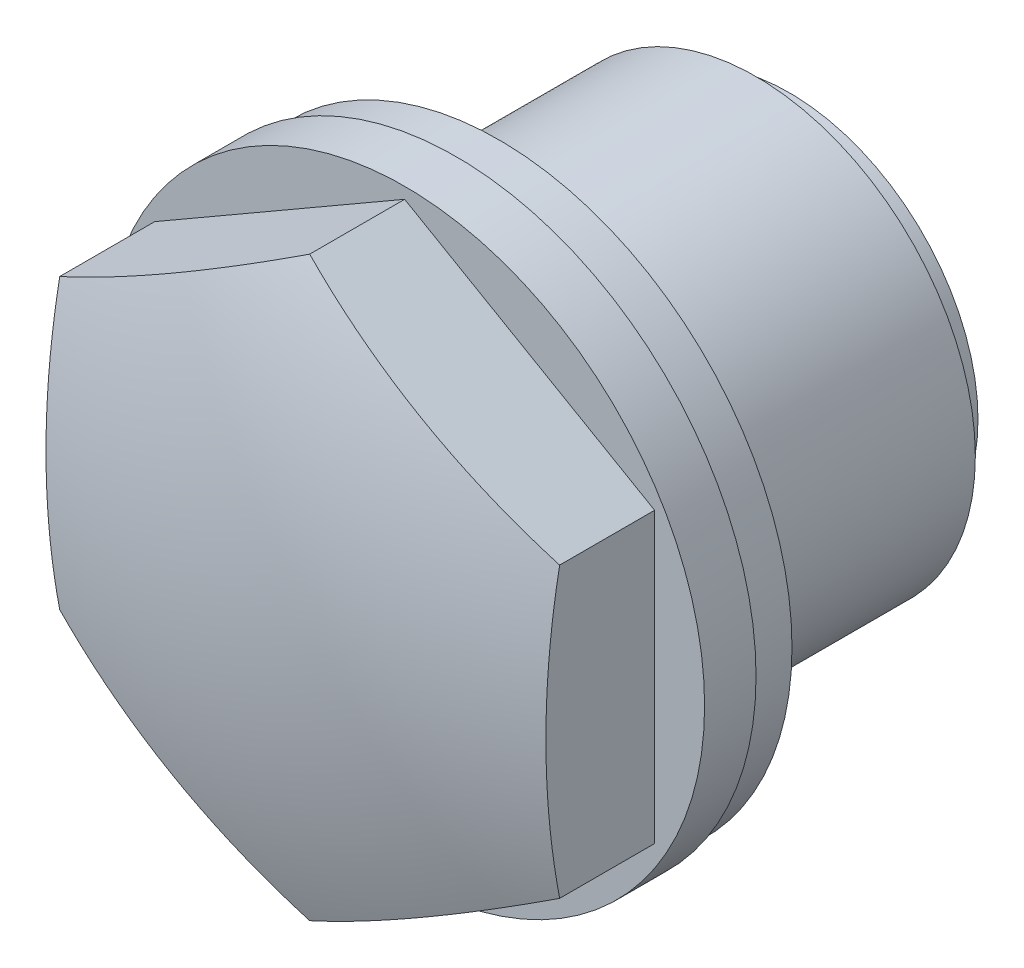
ISO-10303-21;
HEADER;
FILE_DESCRIPTION(('STEP AP214'),'2;1');
FILE_NAME('part.step','',(''),(''),'','','');
FILE_SCHEMA(('AUTOMOTIVE_DESIGN { 1 0 10303 214 1 1 1 1 }'));
ENDSEC;
DATA;
#1=APPLICATION_CONTEXT('core data for automotive mechanical design processes');
#2=APPLICATION_PROTOCOL_DEFINITION('international standard','automotive_design',2000,#1);
#3=PRODUCT_CONTEXT('',#1,'mechanical');
#4=PRODUCT('Part','Part','',(#3));
#5=PRODUCT_RELATED_PRODUCT_CATEGORY('part','',(#4));
#6=PRODUCT_DEFINITION_FORMATION('','',#4);
#7=PRODUCT_DEFINITION_CONTEXT('part definition',#1,'design');
#8=PRODUCT_DEFINITION('design','',#6,#7);
#9=PRODUCT_DEFINITION_SHAPE('','',#8);
#10=(LENGTH_UNIT() NAMED_UNIT(*) SI_UNIT(.MILLI.,.METRE.));
#11=(NAMED_UNIT(*) PLANE_ANGLE_UNIT() SI_UNIT($,.RADIAN.));
#12=(NAMED_UNIT(*) SI_UNIT($,.STERADIAN.) SOLID_ANGLE_UNIT());
#13=UNCERTAINTY_MEASURE_WITH_UNIT(LENGTH_MEASURE(1.E-05),#10,'distance_accuracy_value','');
#14=(GEOMETRIC_REPRESENTATION_CONTEXT(3) GLOBAL_UNCERTAINTY_ASSIGNED_CONTEXT((#13)) GLOBAL_UNIT_ASSIGNED_CONTEXT((#10,
#11,#12)) REPRESENTATION_CONTEXT('',''));
#15=CARTESIAN_POINT('',(0.,0.,0.));
#16=DIRECTION('',(0.,0.,1.));
#17=DIRECTION('',(1.,0.,0.));
#18=AXIS2_PLACEMENT_3D('',#15,#16,#17);
#19=CARTESIAN_POINT('',(0.,0.,7.28589798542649));
#20=DIRECTION('',(0.,0.,1.));
#21=DIRECTION('',(1.,0.,0.));
#22=AXIS2_PLACEMENT_3D('',#19,#20,#21);
#23=CYLINDRICAL_SURFACE('',#22,9.);
#24=CARTESIAN_POINT('',(0.,0.,2.82910786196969));
#25=DIRECTION('',(0.,0.,1.));
#26=DIRECTION('',(1.,0.,0.));
#27=AXIS2_PLACEMENT_3D('',#24,#25,#26);
#28=CIRCLE('',#27,9.);
#29=CARTESIAN_POINT('',(8.99999999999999,0.,2.82910786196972));
#30=VERTEX_POINT('',#29);
#31=EDGE_CURVE('E141',#30,#30,#28,.T.);
#32=ORIENTED_EDGE('',*,*,#31,.F.);
#33=EDGE_LOOP('',(#32));
#34=FACE_BOUND('',#33,.T.);
#35=CARTESIAN_POINT('',(0.,0.,1.28589798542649));
#36=DIRECTION('',(0.,0.,1.));
#37=DIRECTION('',(1.,0.,0.));
#38=AXIS2_PLACEMENT_3D('',#35,#36,#37);
#39=CIRCLE('',#38,9.);
#40=CARTESIAN_POINT('',(8.99999999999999,0.,1.28589798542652));
#41=VERTEX_POINT('',#40);
#42=EDGE_CURVE('E109',#41,#41,#39,.T.);
#43=ORIENTED_EDGE('',*,*,#42,.T.);
#44=EDGE_LOOP('',(#43));
#45=FACE_BOUND('',#44,.T.);
#46=ADVANCED_FACE('F14',(#34,#45),#23,.T.);
#47=CARTESIAN_POINT('',(0.,0.,-18.3521020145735));
#48=DIRECTION('',(0.,0.,1.));
#49=DIRECTION('',(0.,1.,0.));
#50=AXIS2_PLACEMENT_3D('',#47,#48,#49);
#51=SPHERICAL_SURFACE('',#50,24.138);
#52=CARTESIAN_POINT('',(0.,0.,5.30340800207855));
#53=DIRECTION('',(0.,0.,1.));
#54=DIRECTION('',(1.,0.,0.));
#55=AXIS2_PLACEMENT_3D('',#52,#53,#54);
#56=CIRCLE('',#55,4.80207141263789);
#57=CARTESIAN_POINT('',(4.80207141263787,0.,5.30340800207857));
#58=VERTEX_POINT('',#57);
#59=EDGE_CURVE('E133',#58,#58,#56,.T.);
#60=ORIENTED_EDGE('',*,*,#59,.F.);
#61=EDGE_LOOP('',(#60));
#62=FACE_BOUND('',#61,.T.);
#63=ADVANCED_FACE('F16',(#62),#51,.F.);
#64=CARTESIAN_POINT('',(0.,0.,5.30340800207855));
#65=DIRECTION('',(0.,0.,-1.));
#66=DIRECTION('',(-1.,0.,0.));
#67=AXIS2_PLACEMENT_3D('',#64,#65,#66);
#68=CONICAL_SURFACE('',#67,4.80207141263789,0.0349065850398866);
#69=CARTESIAN_POINT('',(0.,0.,-8.71410201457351));
#70=DIRECTION('',(0.,0.,1.));
#71=DIRECTION('',(1.,0.,0.));
#72=AXIS2_PLACEMENT_3D('',#69,#70,#71);
#73=CIRCLE('',#72,5.29157364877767);
#74=CARTESIAN_POINT('',(5.2915736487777,0.,-8.71410201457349));
#75=VERTEX_POINT('',#74);
#76=EDGE_CURVE('E130',#75,#75,#73,.T.);
#77=ORIENTED_EDGE('',*,*,#76,.F.);
#78=EDGE_LOOP('',(#77));
#79=FACE_BOUND('',#78,.T.);
#80=ORIENTED_EDGE('',*,*,#59,.T.);
#81=EDGE_LOOP('',(#80));
#82=FACE_BOUND('',#81,.T.);
#83=ADVANCED_FACE('F175',(#79,#82),#68,.F.);
#84=CARTESIAN_POINT('',(0.,5.29157364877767,-8.71410201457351));
#85=DIRECTION('',(0.,0.,1.));
#86=DIRECTION('',(1.,0.,0.));
#87=AXIS2_PLACEMENT_3D('',#84,#85,#86);
#88=PLANE('',#87);
#89=CARTESIAN_POINT('',(0.,0.,-8.71410201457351));
#90=DIRECTION('',(0.,0.,1.));
#91=DIRECTION('',(1.,0.,0.));
#92=AXIS2_PLACEMENT_3D('',#89,#90,#91);
#93=CIRCLE('',#92,5.6598475);
#94=CARTESIAN_POINT('',(5.65984750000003,0.,-8.71410201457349));
#95=VERTEX_POINT('',#94);
#96=EDGE_CURVE('E127',#95,#95,#93,.T.);
#97=ORIENTED_EDGE('',*,*,#96,.F.);
#98=EDGE_LOOP('',(#97));
#99=FACE_BOUND('',#98,.T.);
#100=ORIENTED_EDGE('',*,*,#76,.T.);
#101=EDGE_LOOP('',(#100));
#102=FACE_BOUND('',#101,.T.);
#103=ADVANCED_FACE('F205',(#99,#102),#88,.F.);
#104=CARTESIAN_POINT('',(0.,0.,7.28589798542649));
#105=DIRECTION('',(0.,0.,1.));
#106=DIRECTION('',(1.,0.,0.));
#107=AXIS2_PLACEMENT_3D('',#104,#105,#106);
#108=CYLINDRICAL_SURFACE('',#107,5.6598475);
#109=CARTESIAN_POINT('',(0.,0.,-7.71410201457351));
#110=DIRECTION('',(0.,0.,1.));
#111=DIRECTION('',(1.,0.,0.));
#112=AXIS2_PLACEMENT_3D('',#109,#110,#111);
#113=CIRCLE('',#112,5.6598475);
#114=CARTESIAN_POINT('',(5.65984750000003,0.,-7.71410201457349));
#115=VERTEX_POINT('',#114);
#116=EDGE_CURVE('E124',#115,#115,#113,.T.);
#117=ORIENTED_EDGE('',*,*,#116,.F.);
#118=EDGE_LOOP('',(#117));
#119=FACE_BOUND('',#118,.T.);
#120=ORIENTED_EDGE('',*,*,#96,.T.);
#121=EDGE_LOOP('',(#120));
#122=FACE_BOUND('',#121,.T.);
#123=ADVANCED_FACE('F201',(#119,#122),#108,.T.);
#124=CARTESIAN_POINT('',(0.,5.6598475,-7.71410201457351));
#125=DIRECTION('',(0.,0.,1.));
#126=DIRECTION('',(1.,0.,0.));
#127=AXIS2_PLACEMENT_3D('',#124,#125,#126);
#128=PLANE('',#127);
#129=CARTESIAN_POINT('',(0.,0.,-7.71410201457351));
#130=DIRECTION('',(0.,0.,1.));
#131=DIRECTION('',(1.,0.,0.));
#132=AXIS2_PLACEMENT_3D('',#129,#130,#131);
#133=CIRCLE('',#132,6.58);
#134=CARTESIAN_POINT('',(6.58000000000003,0.,-7.71410201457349));
#135=VERTEX_POINT('',#134);
#136=EDGE_CURVE('E121',#135,#135,#133,.T.);
#137=ORIENTED_EDGE('',*,*,#136,.F.);
#138=EDGE_LOOP('',(#137));
#139=FACE_BOUND('',#138,.T.);
#140=ORIENTED_EDGE('',*,*,#116,.T.);
#141=EDGE_LOOP('',(#140));
#142=FACE_BOUND('',#141,.T.);
#143=ADVANCED_FACE('F197',(#139,#142),#128,.F.);
#144=CARTESIAN_POINT('',(0.,0.,7.28589798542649));
#145=DIRECTION('',(0.,0.,1.));
#146=DIRECTION('',(1.,0.,0.));
#147=AXIS2_PLACEMENT_3D('',#144,#145,#146);
#148=CYLINDRICAL_SURFACE('',#147,6.58);
#149=CARTESIAN_POINT('',(0.,0.,0.));
#150=DIRECTION('',(0.,0.,1.));
#151=DIRECTION('',(1.,0.,0.));
#152=AXIS2_PLACEMENT_3D('',#149,#150,#151);
#153=CIRCLE('',#152,6.58);
#154=CARTESIAN_POINT('',(6.58,0.,0.));
#155=VERTEX_POINT('',#154);
#156=EDGE_CURVE('E118',#155,#155,#153,.T.);
#157=ORIENTED_EDGE('',*,*,#156,.F.);
#158=EDGE_LOOP('',(#157));
#159=FACE_BOUND('',#158,.T.);
#160=ORIENTED_EDGE('',*,*,#136,.T.);
#161=EDGE_LOOP('',(#160));
#162=FACE_BOUND('',#161,.T.);
#163=ADVANCED_FACE('F193',(#159,#162),#148,.T.);
#164=CARTESIAN_POINT('',(0.,6.58,0.));
#165=DIRECTION('',(0.,0.,1.));
#166=DIRECTION('',(1.,0.,0.));
#167=AXIS2_PLACEMENT_3D('',#164,#165,#166);
#168=PLANE('',#167);
#169=CARTESIAN_POINT('',(0.,0.,0.));
#170=DIRECTION('',(0.,0.,1.));
#171=DIRECTION('',(1.,0.,0.));
#172=AXIS2_PLACEMENT_3D('',#169,#170,#171);
#173=CIRCLE('',#172,8.793);
#174=CARTESIAN_POINT('',(8.793,0.,0.));
#175=VERTEX_POINT('',#174);
#176=EDGE_CURVE('E115',#175,#175,#173,.T.);
#177=ORIENTED_EDGE('',*,*,#176,.F.);
#178=EDGE_LOOP('',(#177));
#179=FACE_BOUND('',#178,.T.);
#180=ORIENTED_EDGE('',*,*,#156,.T.);
#181=EDGE_LOOP('',(#180));
#182=FACE_BOUND('',#181,.T.);
#183=ADVANCED_FACE('F189',(#179,#182),#168,.F.);
#184=CARTESIAN_POINT('',(0.,0.,7.28589798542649));
#185=DIRECTION('',(0.,0.,1.));
#186=DIRECTION('',(1.,0.,0.));
#187=AXIS2_PLACEMENT_3D('',#184,#185,#186);
#188=CYLINDRICAL_SURFACE('',#187,8.793);
#189=CARTESIAN_POINT('',(0.,0.,1.28589798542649));
#190=DIRECTION('',(0.,0.,1.));
#191=DIRECTION('',(1.,0.,0.));
#192=AXIS2_PLACEMENT_3D('',#189,#190,#191);
#193=CIRCLE('',#192,8.793);
#194=CARTESIAN_POINT('',(8.793,0.,1.28589798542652));
#195=VERTEX_POINT('',#194);
#196=EDGE_CURVE('E112',#195,#195,#193,.T.);
#197=ORIENTED_EDGE('',*,*,#196,.F.);
#198=EDGE_LOOP('',(#197));
#199=FACE_BOUND('',#198,.T.);
#200=ORIENTED_EDGE('',*,*,#176,.T.);
#201=EDGE_LOOP('',(#200));
#202=FACE_BOUND('',#201,.T.);
#203=ADVANCED_FACE('F185',(#199,#202),#188,.T.);
#204=CARTESIAN_POINT('',(0.,8.793,1.28589798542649));
#205=DIRECTION('',(0.,0.,1.));
#206=DIRECTION('',(1.,0.,0.));
#207=AXIS2_PLACEMENT_3D('',#204,#205,#206);
#208=PLANE('',#207);
#209=ORIENTED_EDGE('',*,*,#42,.F.);
#210=EDGE_LOOP('',(#209));
#211=FACE_BOUND('',#210,.T.);
#212=ORIENTED_EDGE('',*,*,#196,.T.);
#213=EDGE_LOOP('',(#212));
#214=FACE_BOUND('',#213,.T.);
#215=ADVANCED_FACE('F182',(#211,#214),#208,.F.);
#216=CARTESIAN_POINT('',(0.,0.,-16.8521020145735));
#217=DIRECTION('',(0.,0.,1.));
#218=DIRECTION('',(0.,-1.,0.));
#219=AXIS2_PLACEMENT_3D('',#216,#217,#218);
#220=SPHERICAL_SURFACE('',#219,24.138);
#221=CARTESIAN_POINT('',(3.75000000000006,6.4951905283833,-16.8521020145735));
#222=DIRECTION('',(-0.5,-0.86602540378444,0.));
#223=DIRECTION('',(0.86602540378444,-0.5,0.));
#224=AXIS2_PLACEMENT_3D('',#221,#222,#223);
#225=CIRCLE('',#224,22.9432570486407);
#226=CARTESIAN_POINT('',(0.,8.66025403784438,5.67883325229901));
#227=VERTEX_POINT('',#226);
#228=CARTESIAN_POINT('',(7.5,4.33012701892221,5.67883325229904));
#229=VERTEX_POINT('',#228);
#230=EDGE_CURVE('E86',#227,#229,#225,.F.);
#231=ORIENTED_EDGE('',*,*,#230,.F.);
#232=CARTESIAN_POINT('',(-3.74999999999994,6.49519052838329,-16.8521020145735));
#233=DIRECTION('',(0.5,-0.866025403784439,0.));
#234=DIRECTION('',(0.866025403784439,0.5,0.));
#235=AXIS2_PLACEMENT_3D('',#232,#233,#234);
#236=CIRCLE('',#235,22.9432570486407);
#237=CARTESIAN_POINT('',(-7.5,4.3301270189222,5.67883325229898));
#238=VERTEX_POINT('',#237);
#239=EDGE_CURVE('E136',#238,#227,#236,.F.);
#240=ORIENTED_EDGE('',*,*,#239,.F.);
#241=CARTESIAN_POINT('',(-7.5,0.,-16.8521020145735));
#242=DIRECTION('',(1.,0.,0.));
#243=DIRECTION('',(0.,0.,-1.));
#244=AXIS2_PLACEMENT_3D('',#241,#242,#243);
#245=CIRCLE('',#244,22.9432570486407);
#246=CARTESIAN_POINT('',(-7.5,-4.3301270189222,5.67883325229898));
#247=VERTEX_POINT('',#246);
#248=EDGE_CURVE('E36',#247,#238,#245,.F.);
#249=ORIENTED_EDGE('',*,*,#248,.F.);
#250=CARTESIAN_POINT('',(-3.74999999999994,-6.49519052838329,-16.8521020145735));
#251=DIRECTION('',(0.5,0.866025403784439,0.));
#252=DIRECTION('',(-0.866025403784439,0.5,0.));
#253=AXIS2_PLACEMENT_3D('',#250,#251,#252);
#254=CIRCLE('',#253,22.9432570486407);
#255=CARTESIAN_POINT('',(0.,-8.66025403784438,5.67883325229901));
#256=VERTEX_POINT('',#255);
#257=EDGE_CURVE('E29',#256,#247,#254,.F.);
#258=ORIENTED_EDGE('',*,*,#257,.F.);
#259=CARTESIAN_POINT('',(3.75000000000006,-6.4951905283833,-16.8521020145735));
#260=DIRECTION('',(-0.5,0.86602540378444,0.));
#261=DIRECTION('',(-0.86602540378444,-0.5,0.));
#262=AXIS2_PLACEMENT_3D('',#259,#260,#261);
#263=CIRCLE('',#262,22.9432570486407);
#264=CARTESIAN_POINT('',(7.5,-4.33012701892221,5.67883325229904));
#265=VERTEX_POINT('',#264);
#266=EDGE_CURVE('E98',#265,#256,#263,.F.);
#267=ORIENTED_EDGE('',*,*,#266,.F.);
#268=CARTESIAN_POINT('',(7.5,0.,-16.8521020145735));
#269=DIRECTION('',(-1.,0.,0.));
#270=DIRECTION('',(0.,0.,1.));
#271=AXIS2_PLACEMENT_3D('',#268,#269,#270);
#272=CIRCLE('',#271,22.9432570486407);
#273=EDGE_CURVE('E9',#229,#265,#272,.F.);
#274=ORIENTED_EDGE('',*,*,#273,.F.);
#275=EDGE_LOOP('',(#231,#240,#249,#258,#267,#274));
#276=FACE_BOUND('',#275,.T.);
#277=ADVANCED_FACE('F150',(#276),#220,.T.);
#278=CARTESIAN_POINT('',(0.,0.,2.82910786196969));
#279=DIRECTION('',(0.,0.,1.));
#280=DIRECTION('',(1.,0.,0.));
#281=AXIS2_PLACEMENT_3D('',#278,#279,#280);
#282=PLANE('',#281);
#283=ORIENTED_EDGE('',*,*,#31,.T.);
#284=EDGE_LOOP('',(#283));
#285=FACE_BOUND('',#284,.T.);
#286=DIRECTION('',(-0.86602540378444,-0.5,0.));
#287=VECTOR('',#286,1.);
#288=CARTESIAN_POINT('',(7.5,-4.33012701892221,2.82910786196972));
#289=LINE('',#288,#287);
#290=CARTESIAN_POINT('',(7.5,-4.33012701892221,2.82910786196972));
#291=VERTEX_POINT('',#290);
#292=CARTESIAN_POINT('',(0.,-8.66025403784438,2.82910786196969));
#293=VERTEX_POINT('',#292);
#294=EDGE_CURVE('E80',#291,#293,#289,.T.);
#295=ORIENTED_EDGE('',*,*,#294,.T.);
#296=DIRECTION('',(-0.866025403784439,0.5,0.));
#297=VECTOR('',#296,1.);
#298=CARTESIAN_POINT('',(0.0999999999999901,-8.71798906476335,2.82910786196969));
#299=LINE('',#298,#297);
#300=CARTESIAN_POINT('',(-7.5,-4.3301270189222,2.82910786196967));
#301=VERTEX_POINT('',#300);
#302=EDGE_CURVE('E100',#293,#301,#299,.T.);
#303=ORIENTED_EDGE('',*,*,#302,.T.);
#304=DIRECTION('',(0.,1.,0.));
#305=VECTOR('',#304,1.);
#306=CARTESIAN_POINT('',(-7.5,-4.3301270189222,2.82910786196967));
#307=LINE('',#306,#305);
#308=CARTESIAN_POINT('',(-7.5,4.3301270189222,2.82910786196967));
#309=VERTEX_POINT('',#308);
#310=EDGE_CURVE('E102',#301,#309,#307,.T.);
#311=ORIENTED_EDGE('',*,*,#310,.T.);
#312=DIRECTION('',(0.866025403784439,0.5,0.));
#313=VECTOR('',#312,1.);
#314=CARTESIAN_POINT('',(-7.5,4.3301270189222,2.82910786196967));
#315=LINE('',#314,#313);
#316=CARTESIAN_POINT('',(0.,8.66025403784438,2.82910786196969));
#317=VERTEX_POINT('',#316);
#318=EDGE_CURVE('E77',#309,#317,#315,.T.);
#319=ORIENTED_EDGE('',*,*,#318,.T.);
#320=DIRECTION('',(0.86602540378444,-0.5,0.));
#321=VECTOR('',#320,1.);
#322=CARTESIAN_POINT('',(-0.10000000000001,8.71798906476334,2.82910786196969));
#323=LINE('',#322,#321);
#324=CARTESIAN_POINT('',(7.5,4.33012701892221,2.82910786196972));
#325=VERTEX_POINT('',#324);
#326=EDGE_CURVE('E68',#317,#325,#323,.T.);
#327=ORIENTED_EDGE('',*,*,#326,.T.);
#328=DIRECTION('',(0.,-1.,0.));
#329=VECTOR('',#328,1.);
#330=CARTESIAN_POINT('',(7.5,4.33012701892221,2.82910786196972));
#331=LINE('',#330,#329);
#332=EDGE_CURVE('E73',#325,#291,#331,.T.);
#333=ORIENTED_EDGE('',*,*,#332,.T.);
#334=EDGE_LOOP('',(#295,#303,#311,#319,#327,#333));
#335=FACE_BOUND('',#334,.T.);
#336=ADVANCED_FACE('F71',(#285,#335),#282,.T.);
#337=CARTESIAN_POINT('',(0.0999999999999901,-8.71798906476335,2.82910786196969));
#338=DIRECTION('',(0.5,0.866025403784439,0.));
#339=DIRECTION('',(-0.866025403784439,0.5,0.));
#340=AXIS2_PLACEMENT_3D('',#337,#338,#339);
#341=PLANE('',#340);
#342=ORIENTED_EDGE('',*,*,#302,.F.);
#343=DIRECTION('',(0.,0.,1.));
#344=VECTOR('',#343,1.);
#345=CARTESIAN_POINT('',(0.,-8.66025403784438,2.82910786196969));
#346=LINE('',#345,#344);
#347=EDGE_CURVE('E22',#293,#256,#346,.T.);
#348=ORIENTED_EDGE('',*,*,#347,.T.);
#349=ORIENTED_EDGE('',*,*,#257,.T.);
#350=DIRECTION('',(0.,0.,1.));
#351=VECTOR('',#350,1.);
#352=CARTESIAN_POINT('',(-7.5,-4.3301270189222,2.82910786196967));
#353=LINE('',#352,#351);
#354=EDGE_CURVE('E107',#301,#247,#353,.T.);
#355=ORIENTED_EDGE('',*,*,#354,.F.);
#356=EDGE_LOOP('',(#342,#348,#349,#355));
#357=FACE_BOUND('',#356,.T.);
#358=ADVANCED_FACE('F146',(#357),#341,.F.);
#359=CARTESIAN_POINT('',(-7.5,-4.3301270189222,2.82910786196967));
#360=DIRECTION('',(1.,0.,0.));
#361=DIRECTION('',(0.,0.,-1.));
#362=AXIS2_PLACEMENT_3D('',#359,#360,#361);
#363=PLANE('',#362);
#364=ORIENTED_EDGE('',*,*,#248,.T.);
#365=DIRECTION('',(0.,0.,1.));
#366=VECTOR('',#365,1.);
#367=CARTESIAN_POINT('',(-7.5,4.3301270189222,2.82910786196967));
#368=LINE('',#367,#366);
#369=EDGE_CURVE('E105',#309,#238,#368,.T.);
#370=ORIENTED_EDGE('',*,*,#369,.F.);
#371=ORIENTED_EDGE('',*,*,#310,.F.);
#372=ORIENTED_EDGE('',*,*,#354,.T.);
#373=EDGE_LOOP('',(#364,#370,#371,#372));
#374=FACE_BOUND('',#373,.T.);
#375=ADVANCED_FACE('F155',(#374),#363,.F.);
#376=CARTESIAN_POINT('',(-7.5,4.3301270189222,2.82910786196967));
#377=DIRECTION('',(0.5,-0.866025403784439,0.));
#378=DIRECTION('',(0.866025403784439,0.5,0.));
#379=AXIS2_PLACEMENT_3D('',#376,#377,#378);
#380=PLANE('',#379);
#381=ORIENTED_EDGE('',*,*,#239,.T.);
#382=DIRECTION('',(0.,0.,-1.));
#383=VECTOR('',#382,1.);
#384=CARTESIAN_POINT('',(0.,8.66025403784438,2.82910786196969));
#385=LINE('',#384,#383);
#386=EDGE_CURVE('E144',#227,#317,#385,.T.);
#387=ORIENTED_EDGE('',*,*,#386,.T.);
#388=ORIENTED_EDGE('',*,*,#318,.F.);
#389=ORIENTED_EDGE('',*,*,#369,.T.);
#390=EDGE_LOOP('',(#381,#387,#388,#389));
#391=FACE_BOUND('',#390,.T.);
#392=ADVANCED_FACE('F153',(#391),#380,.F.);
#393=CARTESIAN_POINT('',(7.5,-4.33012701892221,2.82910786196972));
#394=DIRECTION('',(-0.5,0.86602540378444,0.));
#395=DIRECTION('',(-0.86602540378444,-0.5,0.));
#396=AXIS2_PLACEMENT_3D('',#393,#394,#395);
#397=PLANE('',#396);
#398=ORIENTED_EDGE('',*,*,#266,.T.);
#399=ORIENTED_EDGE('',*,*,#347,.F.);
#400=ORIENTED_EDGE('',*,*,#294,.F.);
#401=DIRECTION('',(0.,0.,1.));
#402=VECTOR('',#401,1.);
#403=CARTESIAN_POINT('',(7.5,-4.33012701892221,2.82910786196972));
#404=LINE('',#403,#402);
#405=EDGE_CURVE('E89',#291,#265,#404,.T.);
#406=ORIENTED_EDGE('',*,*,#405,.T.);
#407=EDGE_LOOP('',(#398,#399,#400,#406));
#408=FACE_BOUND('',#407,.T.);
#409=ADVANCED_FACE('F156',(#408),#397,.F.);
#410=CARTESIAN_POINT('',(-0.10000000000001,8.71798906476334,2.82910786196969));
#411=DIRECTION('',(-0.5,-0.86602540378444,0.));
#412=DIRECTION('',(0.86602540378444,-0.5,0.));
#413=AXIS2_PLACEMENT_3D('',#410,#411,#412);
#414=PLANE('',#413);
#415=ORIENTED_EDGE('',*,*,#230,.T.);
#416=DIRECTION('',(0.,0.,1.));
#417=VECTOR('',#416,1.);
#418=CARTESIAN_POINT('',(7.5,4.33012701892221,2.82910786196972));
#419=LINE('',#418,#417);
#420=EDGE_CURVE('E83',#325,#229,#419,.T.);
#421=ORIENTED_EDGE('',*,*,#420,.F.);
#422=ORIENTED_EDGE('',*,*,#326,.F.);
#423=ORIENTED_EDGE('',*,*,#386,.F.);
#424=EDGE_LOOP('',(#415,#421,#422,#423));
#425=FACE_BOUND('',#424,.T.);
#426=ADVANCED_FACE('F84',(#425),#414,.F.);
#427=CARTESIAN_POINT('',(7.5,4.33012701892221,2.82910786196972));
#428=DIRECTION('',(-1.,0.,0.));
#429=DIRECTION('',(0.,0.,1.));
#430=AXIS2_PLACEMENT_3D('',#427,#428,#429);
#431=PLANE('',#430);
#432=ORIENTED_EDGE('',*,*,#273,.T.);
#433=ORIENTED_EDGE('',*,*,#405,.F.);
#434=ORIENTED_EDGE('',*,*,#332,.F.);
#435=ORIENTED_EDGE('',*,*,#420,.T.);
#436=EDGE_LOOP('',(#432,#433,#434,#435));
#437=FACE_BOUND('',#436,.T.);
#438=ADVANCED_FACE('F91',(#437),#431,.F.);
#439=CLOSED_SHELL('',(#46,#63,#83,#103,#123,#143,#163,#183,#203,#215,#277,#336,#358,#375,#392,
#409,#426,#438));
#440=MANIFOLD_SOLID_BREP('B1',#439);
#441=ADVANCED_BREP_SHAPE_REPRESENTATION('',(#18,#440),#14);
#442=SHAPE_DEFINITION_REPRESENTATION(#9,#441);
ENDSEC;
END-ISO-10303-21;
